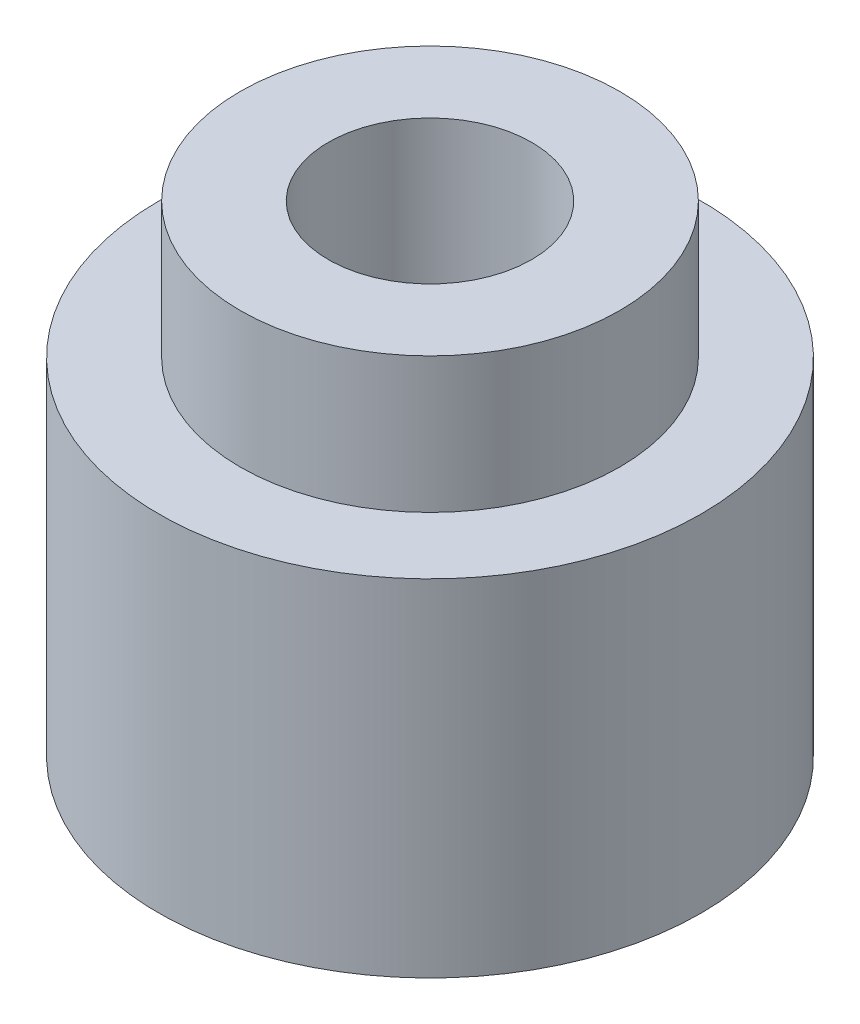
ISO-10303-21;
HEADER;
FILE_DESCRIPTION(('STEP AP214'),'2;1');
FILE_NAME('part.step','',(''),(''),'','','');
FILE_SCHEMA(('AUTOMOTIVE_DESIGN { 1 0 10303 214 1 1 1 1 }'));
ENDSEC;
DATA;
#1=APPLICATION_CONTEXT('core data for automotive mechanical design processes');
#2=APPLICATION_PROTOCOL_DEFINITION('international standard','automotive_design',2000,#1);
#3=PRODUCT_CONTEXT('',#1,'mechanical');
#4=PRODUCT('Part','Part','',(#3));
#5=PRODUCT_RELATED_PRODUCT_CATEGORY('part','',(#4));
#6=PRODUCT_DEFINITION_FORMATION('','',#4);
#7=PRODUCT_DEFINITION_CONTEXT('part definition',#1,'design');
#8=PRODUCT_DEFINITION('design','',#6,#7);
#9=PRODUCT_DEFINITION_SHAPE('','',#8);
#10=(LENGTH_UNIT() NAMED_UNIT(*) SI_UNIT(.MILLI.,.METRE.));
#11=(NAMED_UNIT(*) PLANE_ANGLE_UNIT() SI_UNIT($,.RADIAN.));
#12=(NAMED_UNIT(*) SI_UNIT($,.STERADIAN.) SOLID_ANGLE_UNIT());
#13=UNCERTAINTY_MEASURE_WITH_UNIT(LENGTH_MEASURE(1.E-05),#10,'distance_accuracy_value','');
#14=(GEOMETRIC_REPRESENTATION_CONTEXT(3) GLOBAL_UNCERTAINTY_ASSIGNED_CONTEXT((#13)) GLOBAL_UNIT_ASSIGNED_CONTEXT((#10,
#11,#12)) REPRESENTATION_CONTEXT('',''));
#15=CARTESIAN_POINT('',(0.,0.,0.));
#16=DIRECTION('',(0.,0.,1.));
#17=DIRECTION('',(1.,0.,0.));
#18=AXIS2_PLACEMENT_3D('',#15,#16,#17);
#19=CARTESIAN_POINT('',(2.25,1.21134870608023,0.));
#20=DIRECTION('',(0.,1.,0.));
#21=DIRECTION('',(0.,0.,1.));
#22=AXIS2_PLACEMENT_3D('',#19,#20,#21);
#23=PLANE('',#22);
#24=CARTESIAN_POINT('',(0.,1.21134870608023,0.));
#25=DIRECTION('',(0.,-1.,0.));
#26=DIRECTION('',(1.,0.,0.));
#27=AXIS2_PLACEMENT_3D('',#24,#25,#26);
#28=CIRCLE('',#27,1.5);
#29=CARTESIAN_POINT('',(1.5,1.21134870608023,0.));
#30=VERTEX_POINT('',#29);
#31=EDGE_CURVE('E34',#30,#30,#28,.T.);
#32=ORIENTED_EDGE('',*,*,#31,.T.);
#33=EDGE_LOOP('',(#32));
#34=FACE_BOUND('',#33,.T.);
#35=CARTESIAN_POINT('',(0.,1.21134870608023,0.));
#36=DIRECTION('',(0.,1.,0.));
#37=DIRECTION('',(0.,0.,1.));
#38=AXIS2_PLACEMENT_3D('',#35,#36,#37);
#39=CIRCLE('',#38,2.8);
#40=CARTESIAN_POINT('',(0.,1.21134870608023,2.8));
#41=VERTEX_POINT('',#40);
#42=EDGE_CURVE('E55',#41,#41,#39,.T.);
#43=ORIENTED_EDGE('',*,*,#42,.T.);
#44=EDGE_LOOP('',(#43));
#45=FACE_BOUND('',#44,.T.);
#46=ADVANCED_FACE('F30',(#34,#45),#23,.T.);
#47=CARTESIAN_POINT('',(0.,-2.33865129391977,0.));
#48=DIRECTION('',(0.,-1.,0.));
#49=DIRECTION('',(1.,0.,0.));
#50=AXIS2_PLACEMENT_3D('',#47,#48,#49);
#51=CYLINDRICAL_SURFACE('',#50,1.5);
#52=CARTESIAN_POINT('',(0.,-5.88865129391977,0.));
#53=DIRECTION('',(0.,-1.,0.));
#54=DIRECTION('',(1.,0.,0.));
#55=AXIS2_PLACEMENT_3D('',#52,#53,#54);
#56=CIRCLE('',#55,1.5);
#57=CARTESIAN_POINT('',(1.5,-5.88865129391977,0.));
#58=VERTEX_POINT('',#57);
#59=EDGE_CURVE('E43',#58,#58,#56,.F.);
#60=ORIENTED_EDGE('',*,*,#59,.F.);
#61=EDGE_LOOP('',(#60));
#62=FACE_BOUND('',#61,.T.);
#63=ORIENTED_EDGE('',*,*,#31,.F.);
#64=EDGE_LOOP('',(#63));
#65=FACE_BOUND('',#64,.T.);
#66=ADVANCED_FACE('F66',(#62,#65),#51,.F.);
#67=CARTESIAN_POINT('',(2.75,-5.88865129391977,0.));
#68=DIRECTION('',(0.,-1.,0.));
#69=DIRECTION('',(0.,0.,-1.));
#70=AXIS2_PLACEMENT_3D('',#67,#68,#69);
#71=PLANE('',#70);
#72=ORIENTED_EDGE('',*,*,#59,.T.);
#73=EDGE_LOOP('',(#72));
#74=FACE_BOUND('',#73,.T.);
#75=CARTESIAN_POINT('',(0.,-5.88865129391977,0.));
#76=DIRECTION('',(0.,-1.,0.));
#77=DIRECTION('',(1.,0.,0.));
#78=AXIS2_PLACEMENT_3D('',#75,#76,#77);
#79=CIRCLE('',#78,4.);
#80=CARTESIAN_POINT('',(4.,-5.88865129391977,0.));
#81=VERTEX_POINT('',#80);
#82=EDGE_CURVE('E38',#81,#81,#79,.F.);
#83=ORIENTED_EDGE('',*,*,#82,.F.);
#84=EDGE_LOOP('',(#83));
#85=FACE_BOUND('',#84,.T.);
#86=ADVANCED_FACE('F73',(#74,#85),#71,.T.);
#87=CARTESIAN_POINT('',(3.5,-0.788651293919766,0.));
#88=DIRECTION('',(0.,1.,0.));
#89=DIRECTION('',(0.,0.,1.));
#90=AXIS2_PLACEMENT_3D('',#87,#88,#89);
#91=PLANE('',#90);
#92=CARTESIAN_POINT('',(0.,-0.788651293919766,0.));
#93=DIRECTION('',(0.,-1.,0.));
#94=DIRECTION('',(1.,0.,0.));
#95=AXIS2_PLACEMENT_3D('',#92,#93,#94);
#96=CIRCLE('',#95,4.);
#97=CARTESIAN_POINT('',(4.,-0.788651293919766,0.));
#98=VERTEX_POINT('',#97);
#99=EDGE_CURVE('E10',#98,#98,#96,.T.);
#100=ORIENTED_EDGE('',*,*,#99,.F.);
#101=EDGE_LOOP('',(#100));
#102=FACE_BOUND('',#101,.T.);
#103=CARTESIAN_POINT('',(0.,-0.788651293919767,0.));
#104=DIRECTION('',(0.,1.,0.));
#105=DIRECTION('',(0.,0.,1.));
#106=AXIS2_PLACEMENT_3D('',#103,#104,#105);
#107=CIRCLE('',#106,2.8);
#108=CARTESIAN_POINT('',(0.,-0.788651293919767,2.8));
#109=VERTEX_POINT('',#108);
#110=EDGE_CURVE('E46',#109,#109,#107,.F.);
#111=ORIENTED_EDGE('',*,*,#110,.T.);
#112=EDGE_LOOP('',(#111));
#113=FACE_BOUND('',#112,.T.);
#114=ADVANCED_FACE('F70',(#102,#113),#91,.T.);
#115=CARTESIAN_POINT('',(0.,-3.33865129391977,0.));
#116=DIRECTION('',(0.,-1.,0.));
#117=DIRECTION('',(1.,0.,0.));
#118=AXIS2_PLACEMENT_3D('',#115,#116,#117);
#119=CYLINDRICAL_SURFACE('',#118,4.);
#120=ORIENTED_EDGE('',*,*,#99,.T.);
#121=EDGE_LOOP('',(#120));
#122=FACE_BOUND('',#121,.T.);
#123=ORIENTED_EDGE('',*,*,#82,.T.);
#124=EDGE_LOOP('',(#123));
#125=FACE_BOUND('',#124,.T.);
#126=ADVANCED_FACE('F32',(#122,#125),#119,.T.);
#127=CARTESIAN_POINT('',(0.,-9.27393266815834,0.));
#128=DIRECTION('',(0.,1.,0.));
#129=DIRECTION('',(0.,0.,1.));
#130=AXIS2_PLACEMENT_3D('',#127,#128,#129);
#131=CYLINDRICAL_SURFACE('',#130,2.8);
#132=ORIENTED_EDGE('',*,*,#110,.F.);
#133=EDGE_LOOP('',(#132));
#134=FACE_BOUND('',#133,.T.);
#135=ORIENTED_EDGE('',*,*,#42,.F.);
#136=EDGE_LOOP('',(#135));
#137=FACE_BOUND('',#136,.T.);
#138=ADVANCED_FACE('F62',(#134,#137),#131,.T.);
#139=CLOSED_SHELL('',(#46,#66,#86,#114,#126,#138));
#140=MANIFOLD_SOLID_BREP('B2',#139);
#141=ADVANCED_BREP_SHAPE_REPRESENTATION('',(#18,#140),#14);
#142=SHAPE_DEFINITION_REPRESENTATION(#9,#141);
ENDSEC;
END-ISO-10303-21;
